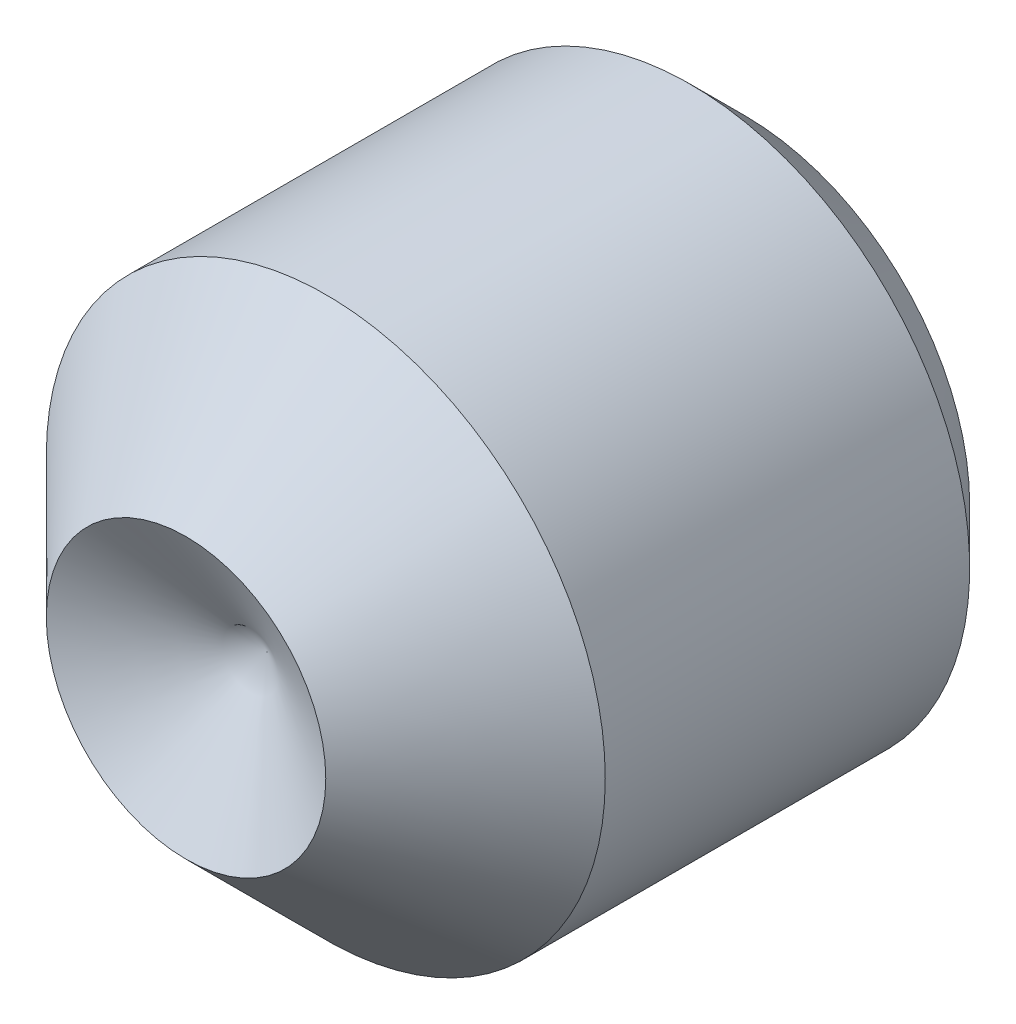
from build123d import *

# Parameters (mm, degrees)
CUT_EXTRUDE1_DEPTH = 2.5


with BuildPart() as part:
    # Logo3_bib1 → Revolve1 (revolve)
    with BuildSketch(Plane(origin=(0, 0, 0), x_dir=(-1, 0, 0), z_dir=(0, -1, 0))):
        Polygon((0, -6.35), (0, 0), (2.5527, 0), (3.175, -0.6223), (3.175, -5.7277), (2.5527, -6.35), align=None)
    revolve(axis=Axis((0, 0, -10.585154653), (0, 0, 1)))

    # Logo3_bib11 → Cut-Extrude1 (cut)
    with BuildSketch(Plane(origin=(0, 0, 0), x_dir=(1, 0, 0), z_dir=(0, 0, -1))):
        Polygon((1.833087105, 0), (0.916543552, 1.5875), (-0.916543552, 1.5875), (-1.833087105, 0), (-0.916543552, -1.5875), (0.916543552, -1.5875), align=None)
    extrude(amount=-CUT_EXTRUDE1_DEPTH, mode=Mode.SUBTRACT)

    # Logo3_bib3 → Type3 (revolve, cut)
    with BuildSketch(Plane(origin=(0, 0, 0), x_dir=(1, 0, 0), z_dir=(0, 1, 0)), mode=Mode.PRIVATE) as type3_sk:
        Polygon((-1.5875, -6.35), (-3.175, -4.7625), (-4.175, -4.7625), (-4.175, -7.35), (0, -7.35), (0, -5.433456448), align=None)
    revolve(type3_sk.sketch.rotate(Axis((0, 0, 43.517168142), (0, 0, -1)), 180), axis=Axis((0, 0, 43.517168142), (0, 0, -1)), mode=Mode.SUBTRACT)


solid = part.part
